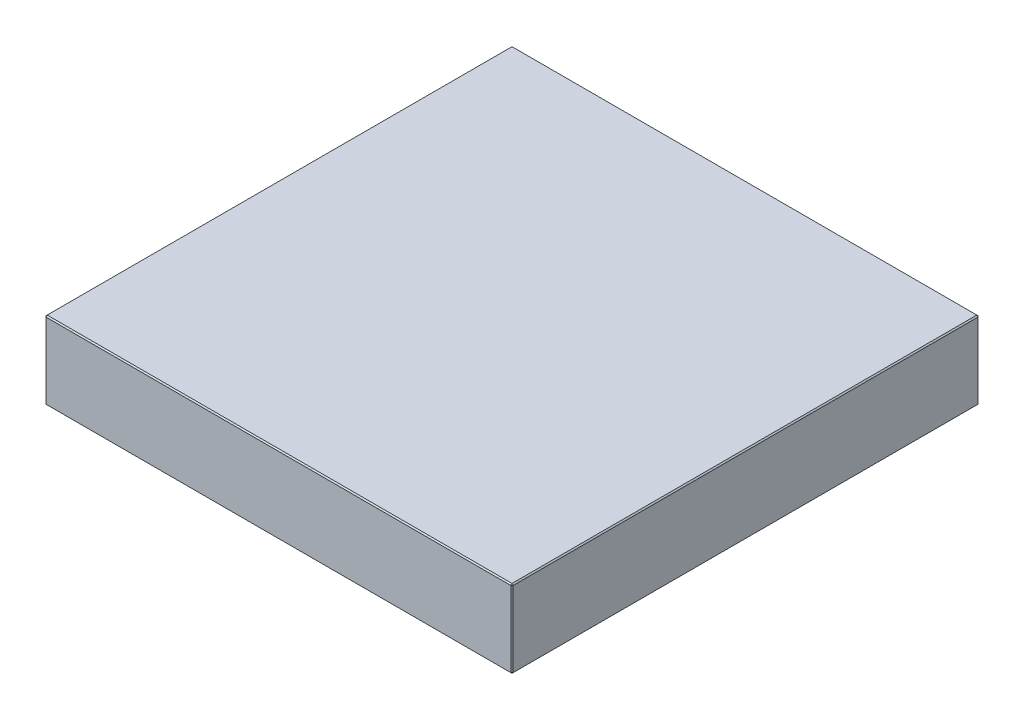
ISO-10303-21;
HEADER;
FILE_DESCRIPTION(('STEP AP214'),'2;1');
FILE_NAME('part.step','',(''),(''),'','','');
FILE_SCHEMA(('AUTOMOTIVE_DESIGN { 1 0 10303 214 1 1 1 1 }'));
ENDSEC;
DATA;
#1=APPLICATION_CONTEXT('core data for automotive mechanical design processes');
#2=APPLICATION_PROTOCOL_DEFINITION('international standard','automotive_design',2000,#1);
#3=PRODUCT_CONTEXT('',#1,'mechanical');
#4=PRODUCT('Part','Part','',(#3));
#5=PRODUCT_RELATED_PRODUCT_CATEGORY('part','',(#4));
#6=PRODUCT_DEFINITION_FORMATION('','',#4);
#7=PRODUCT_DEFINITION_CONTEXT('part definition',#1,'design');
#8=PRODUCT_DEFINITION('design','',#6,#7);
#9=PRODUCT_DEFINITION_SHAPE('','',#8);
#10=(LENGTH_UNIT() NAMED_UNIT(*) SI_UNIT(.MILLI.,.METRE.));
#11=(NAMED_UNIT(*) PLANE_ANGLE_UNIT() SI_UNIT($,.RADIAN.));
#12=(NAMED_UNIT(*) SI_UNIT($,.STERADIAN.) SOLID_ANGLE_UNIT());
#13=UNCERTAINTY_MEASURE_WITH_UNIT(LENGTH_MEASURE(1.E-05),#10,'distance_accuracy_value','');
#14=(GEOMETRIC_REPRESENTATION_CONTEXT(3) GLOBAL_UNCERTAINTY_ASSIGNED_CONTEXT((#13)) GLOBAL_UNIT_ASSIGNED_CONTEXT((#10,
#11,#12)) REPRESENTATION_CONTEXT('',''));
#15=CARTESIAN_POINT('',(0.,0.,0.));
#16=DIRECTION('',(0.,0.,1.));
#17=DIRECTION('',(1.,0.,0.));
#18=AXIS2_PLACEMENT_3D('',#15,#16,#17);
#19=CARTESIAN_POINT('',(-198.,66.,198.));
#20=DIRECTION('',(1.,0.,0.));
#21=DIRECTION('',(0.,0.,-1.));
#22=AXIS2_PLACEMENT_3D('',#19,#20,#21);
#23=PLANE('',#22);
#24=DIRECTION('',(0.,-1.,0.));
#25=VECTOR('',#24,1.);
#26=CARTESIAN_POINT('',(-198.,66.,-197.));
#27=LINE('',#26,#25);
#28=CARTESIAN_POINT('',(-198.,65.,-197.));
#29=VERTEX_POINT('',#28);
#30=CARTESIAN_POINT('',(-198.,1.,-197.));
#31=VERTEX_POINT('',#30);
#32=EDGE_CURVE('E114',#29,#31,#27,.T.);
#33=ORIENTED_EDGE('',*,*,#32,.T.);
#34=DIRECTION('',(0.,0.,1.));
#35=VECTOR('',#34,1.);
#36=CARTESIAN_POINT('',(-198.,1.,198.));
#37=LINE('',#36,#35);
#38=CARTESIAN_POINT('',(-198.,1.,197.));
#39=VERTEX_POINT('',#38);
#40=EDGE_CURVE('E110',#31,#39,#37,.T.);
#41=ORIENTED_EDGE('',*,*,#40,.T.);
#42=DIRECTION('',(0.,1.,0.));
#43=VECTOR('',#42,1.);
#44=CARTESIAN_POINT('',(-198.,66.,197.));
#45=LINE('',#44,#43);
#46=CARTESIAN_POINT('',(-198.,65.,197.));
#47=VERTEX_POINT('',#46);
#48=EDGE_CURVE('E103',#39,#47,#45,.T.);
#49=ORIENTED_EDGE('',*,*,#48,.T.);
#50=DIRECTION('',(0.,0.,-1.));
#51=VECTOR('',#50,1.);
#52=CARTESIAN_POINT('',(-198.,65.,-198.));
#53=LINE('',#52,#51);
#54=EDGE_CURVE('E107',#47,#29,#53,.T.);
#55=ORIENTED_EDGE('',*,*,#54,.T.);
#56=EDGE_LOOP('',(#33,#41,#49,#55));
#57=FACE_BOUND('',#56,.T.);
#58=ADVANCED_FACE('F15',(#57),#23,.F.);
#59=CARTESIAN_POINT('',(198.,66.,198.));
#60=DIRECTION('',(0.,0.,-1.));
#61=DIRECTION('',(-1.,0.,0.));
#62=AXIS2_PLACEMENT_3D('',#59,#60,#61);
#63=PLANE('',#62);
#64=DIRECTION('',(-1.,0.,0.));
#65=VECTOR('',#64,1.);
#66=CARTESIAN_POINT('',(-198.,65.,198.));
#67=LINE('',#66,#65);
#68=CARTESIAN_POINT('',(197.,65.,198.));
#69=VERTEX_POINT('',#68);
#70=CARTESIAN_POINT('',(-197.,65.,198.));
#71=VERTEX_POINT('',#70);
#72=EDGE_CURVE('E164',#69,#71,#67,.T.);
#73=ORIENTED_EDGE('',*,*,#72,.T.);
#74=DIRECTION('',(0.,-1.,0.));
#75=VECTOR('',#74,1.);
#76=CARTESIAN_POINT('',(-197.,66.,198.));
#77=LINE('',#76,#75);
#78=CARTESIAN_POINT('',(-197.,1.,198.));
#79=VERTEX_POINT('',#78);
#80=EDGE_CURVE('E122',#71,#79,#77,.T.);
#81=ORIENTED_EDGE('',*,*,#80,.T.);
#82=DIRECTION('',(1.,0.,0.));
#83=VECTOR('',#82,1.);
#84=CARTESIAN_POINT('',(198.,1.,198.));
#85=LINE('',#84,#83);
#86=CARTESIAN_POINT('',(197.,1.,198.));
#87=VERTEX_POINT('',#86);
#88=EDGE_CURVE('E168',#79,#87,#85,.T.);
#89=ORIENTED_EDGE('',*,*,#88,.T.);
#90=DIRECTION('',(0.,1.,0.));
#91=VECTOR('',#90,1.);
#92=CARTESIAN_POINT('',(197.,66.,198.));
#93=LINE('',#92,#91);
#94=EDGE_CURVE('E166',#87,#69,#93,.T.);
#95=ORIENTED_EDGE('',*,*,#94,.T.);
#96=EDGE_LOOP('',(#73,#81,#89,#95));
#97=FACE_BOUND('',#96,.T.);
#98=ADVANCED_FACE('F275',(#97),#63,.F.);
#99=CARTESIAN_POINT('',(198.,66.,198.));
#100=DIRECTION('',(-1.,0.,0.));
#101=DIRECTION('',(0.,0.,1.));
#102=AXIS2_PLACEMENT_3D('',#99,#100,#101);
#103=PLANE('',#102);
#104=DIRECTION('',(0.,0.,-1.));
#105=VECTOR('',#104,1.);
#106=CARTESIAN_POINT('',(198.,1.,198.));
#107=LINE('',#106,#105);
#108=CARTESIAN_POINT('',(198.,1.,197.));
#109=VERTEX_POINT('',#108);
#110=CARTESIAN_POINT('',(198.,1.,-197.));
#111=VERTEX_POINT('',#110);
#112=EDGE_CURVE('E159',#109,#111,#107,.T.);
#113=ORIENTED_EDGE('',*,*,#112,.T.);
#114=DIRECTION('',(0.,1.,0.));
#115=VECTOR('',#114,1.);
#116=CARTESIAN_POINT('',(198.,66.,-197.));
#117=LINE('',#116,#115);
#118=CARTESIAN_POINT('',(198.,65.,-197.));
#119=VERTEX_POINT('',#118);
#120=EDGE_CURVE('E161',#111,#119,#117,.T.);
#121=ORIENTED_EDGE('',*,*,#120,.T.);
#122=DIRECTION('',(0.,0.,1.));
#123=VECTOR('',#122,1.);
#124=CARTESIAN_POINT('',(198.,65.,198.));
#125=LINE('',#124,#123);
#126=CARTESIAN_POINT('',(198.,65.,197.));
#127=VERTEX_POINT('',#126);
#128=EDGE_CURVE('E155',#119,#127,#125,.T.);
#129=ORIENTED_EDGE('',*,*,#128,.T.);
#130=DIRECTION('',(0.,-1.,0.));
#131=VECTOR('',#130,1.);
#132=CARTESIAN_POINT('',(198.,66.,197.));
#133=LINE('',#132,#131);
#134=EDGE_CURVE('E157',#127,#109,#133,.T.);
#135=ORIENTED_EDGE('',*,*,#134,.T.);
#136=EDGE_LOOP('',(#113,#121,#129,#135));
#137=FACE_BOUND('',#136,.T.);
#138=ADVANCED_FACE('F254',(#137),#103,.F.);
#139=CARTESIAN_POINT('',(198.,66.,-198.));
#140=DIRECTION('',(0.,0.,1.));
#141=DIRECTION('',(1.,0.,0.));
#142=AXIS2_PLACEMENT_3D('',#139,#140,#141);
#143=PLANE('',#142);
#144=DIRECTION('',(0.,-1.,0.));
#145=VECTOR('',#144,1.);
#146=CARTESIAN_POINT('',(197.,66.,-198.));
#147=LINE('',#146,#145);
#148=CARTESIAN_POINT('',(197.,65.,-198.));
#149=VERTEX_POINT('',#148);
#150=CARTESIAN_POINT('',(197.,1.,-198.));
#151=VERTEX_POINT('',#150);
#152=EDGE_CURVE('E148',#149,#151,#147,.T.);
#153=ORIENTED_EDGE('',*,*,#152,.T.);
#154=DIRECTION('',(-1.,0.,0.));
#155=VECTOR('',#154,1.);
#156=CARTESIAN_POINT('',(198.,1.,-198.));
#157=LINE('',#156,#155);
#158=CARTESIAN_POINT('',(-197.,1.,-198.));
#159=VERTEX_POINT('',#158);
#160=EDGE_CURVE('E153',#151,#159,#157,.T.);
#161=ORIENTED_EDGE('',*,*,#160,.T.);
#162=DIRECTION('',(0.,1.,0.));
#163=VECTOR('',#162,1.);
#164=CARTESIAN_POINT('',(-197.,66.,-198.));
#165=LINE('',#164,#163);
#166=CARTESIAN_POINT('',(-197.,65.,-198.));
#167=VERTEX_POINT('',#166);
#168=EDGE_CURVE('E150',#159,#167,#165,.T.);
#169=ORIENTED_EDGE('',*,*,#168,.T.);
#170=DIRECTION('',(1.,0.,0.));
#171=VECTOR('',#170,1.);
#172=CARTESIAN_POINT('',(198.,65.,-198.));
#173=LINE('',#172,#171);
#174=EDGE_CURVE('E146',#167,#149,#173,.T.);
#175=ORIENTED_EDGE('',*,*,#174,.T.);
#176=EDGE_LOOP('',(#153,#161,#169,#175));
#177=FACE_BOUND('',#176,.T.);
#178=ADVANCED_FACE('F284',(#177),#143,.F.);
#179=CARTESIAN_POINT('',(0.,66.,0.));
#180=DIRECTION('',(0.,1.,0.));
#181=DIRECTION('',(0.,0.,1.));
#182=AXIS2_PLACEMENT_3D('',#179,#180,#181);
#183=PLANE('',#182);
#184=DIRECTION('',(0.,0.,-1.));
#185=VECTOR('',#184,1.);
#186=CARTESIAN_POINT('',(197.,66.,-198.));
#187=LINE('',#186,#185);
#188=CARTESIAN_POINT('',(197.,66.,197.));
#189=VERTEX_POINT('',#188);
#190=CARTESIAN_POINT('',(197.,66.,-197.));
#191=VERTEX_POINT('',#190);
#192=EDGE_CURVE('E24',#189,#191,#187,.T.);
#193=ORIENTED_EDGE('',*,*,#192,.T.);
#194=DIRECTION('',(-1.,0.,0.));
#195=VECTOR('',#194,1.);
#196=CARTESIAN_POINT('',(-198.,66.,-197.));
#197=LINE('',#196,#195);
#198=CARTESIAN_POINT('',(-197.,66.,-197.));
#199=VERTEX_POINT('',#198);
#200=EDGE_CURVE('E9',#191,#199,#197,.T.);
#201=ORIENTED_EDGE('',*,*,#200,.T.);
#202=DIRECTION('',(0.,0.,1.));
#203=VECTOR('',#202,1.);
#204=CARTESIAN_POINT('',(-197.,66.,198.));
#205=LINE('',#204,#203);
#206=CARTESIAN_POINT('',(-197.,66.,197.));
#207=VERTEX_POINT('',#206);
#208=EDGE_CURVE('E180',#199,#207,#205,.T.);
#209=ORIENTED_EDGE('',*,*,#208,.T.);
#210=DIRECTION('',(1.,0.,0.));
#211=VECTOR('',#210,1.);
#212=CARTESIAN_POINT('',(198.,66.,197.));
#213=LINE('',#212,#211);
#214=EDGE_CURVE('E35',#207,#189,#213,.T.);
#215=ORIENTED_EDGE('',*,*,#214,.T.);
#216=EDGE_LOOP('',(#193,#201,#209,#215));
#217=FACE_BOUND('',#216,.T.);
#218=ADVANCED_FACE('F350',(#217),#183,.T.);
#219=CARTESIAN_POINT('',(0.,0.,0.));
#220=DIRECTION('',(0.,1.,0.));
#221=DIRECTION('',(0.,0.,1.));
#222=AXIS2_PLACEMENT_3D('',#219,#220,#221);
#223=PLANE('',#222);
#224=DIRECTION('',(0.,0.,1.));
#225=VECTOR('',#224,1.);
#226=CARTESIAN_POINT('',(197.,0.,0.));
#227=LINE('',#226,#225);
#228=CARTESIAN_POINT('',(197.,0.,-197.));
#229=VERTEX_POINT('',#228);
#230=CARTESIAN_POINT('',(197.,0.,197.));
#231=VERTEX_POINT('',#230);
#232=EDGE_CURVE('E171',#229,#231,#227,.T.);
#233=ORIENTED_EDGE('',*,*,#232,.T.);
#234=DIRECTION('',(-1.,0.,0.));
#235=VECTOR('',#234,1.);
#236=CARTESIAN_POINT('',(0.,0.,197.));
#237=LINE('',#236,#235);
#238=CARTESIAN_POINT('',(-197.,0.,197.));
#239=VERTEX_POINT('',#238);
#240=EDGE_CURVE('E177',#231,#239,#237,.T.);
#241=ORIENTED_EDGE('',*,*,#240,.T.);
#242=DIRECTION('',(0.,0.,-1.));
#243=VECTOR('',#242,1.);
#244=CARTESIAN_POINT('',(-197.,0.,0.));
#245=LINE('',#244,#243);
#246=CARTESIAN_POINT('',(-197.,0.,-197.));
#247=VERTEX_POINT('',#246);
#248=EDGE_CURVE('E175',#239,#247,#245,.T.);
#249=ORIENTED_EDGE('',*,*,#248,.T.);
#250=DIRECTION('',(1.,0.,0.));
#251=VECTOR('',#250,1.);
#252=CARTESIAN_POINT('',(0.,0.,-197.));
#253=LINE('',#252,#251);
#254=EDGE_CURVE('E173',#247,#229,#253,.T.);
#255=ORIENTED_EDGE('',*,*,#254,.T.);
#256=EDGE_LOOP('',(#233,#241,#249,#255));
#257=FACE_BOUND('',#256,.T.);
#258=ADVANCED_FACE('F246',(#257),#223,.F.);
#259=CARTESIAN_POINT('',(198.,66.,197.));
#260=DIRECTION('',(-0.707106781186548,0.,-0.707106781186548));
#261=DIRECTION('',(0.,-1.,0.));
#262=AXIS2_PLACEMENT_3D('',#259,#260,#261);
#263=PLANE('',#262);
#264=DIRECTION('',(-0.707106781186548,0.,0.707106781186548));
#265=VECTOR('',#264,1.);
#266=CARTESIAN_POINT('',(197.,65.,198.));
#267=LINE('',#266,#265);
#268=EDGE_CURVE('E19',#69,#127,#267,.F.);
#269=ORIENTED_EDGE('',*,*,#268,.F.);
#270=ORIENTED_EDGE('',*,*,#94,.F.);
#271=DIRECTION('',(0.707106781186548,0.,-0.707106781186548));
#272=VECTOR('',#271,1.);
#273=CARTESIAN_POINT('',(197.,1.,198.));
#274=LINE('',#273,#272);
#275=EDGE_CURVE('E142',#109,#87,#274,.F.);
#276=ORIENTED_EDGE('',*,*,#275,.F.);
#277=ORIENTED_EDGE('',*,*,#134,.F.);
#278=EDGE_LOOP('',(#269,#270,#276,#277));
#279=FACE_BOUND('',#278,.T.);
#280=ADVANCED_FACE('F17',(#279),#263,.F.);
#281=CARTESIAN_POINT('',(197.,65.,198.));
#282=DIRECTION('',(0.577350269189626,0.577350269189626,0.577350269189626));
#283=DIRECTION('',(0.707106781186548,0.,-0.707106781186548));
#284=AXIS2_PLACEMENT_3D('',#281,#282,#283);
#285=PLANE('',#284);
#286=DIRECTION('',(0.,-0.707106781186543,0.707106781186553));
#287=VECTOR('',#286,1.);
#288=CARTESIAN_POINT('',(197.,65.,198.));
#289=LINE('',#288,#287);
#290=EDGE_CURVE('E226',#69,#189,#289,.F.);
#291=ORIENTED_EDGE('',*,*,#290,.F.);
#292=ORIENTED_EDGE('',*,*,#268,.T.);
#293=DIRECTION('',(-0.707106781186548,0.707106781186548,0.));
#294=VECTOR('',#293,1.);
#295=CARTESIAN_POINT('',(197.5,65.5,197.));
#296=LINE('',#295,#294);
#297=EDGE_CURVE('E228',#189,#127,#296,.F.);
#298=ORIENTED_EDGE('',*,*,#297,.F.);
#299=EDGE_LOOP('',(#291,#292,#298));
#300=FACE_BOUND('',#299,.T.);
#301=ADVANCED_FACE('F270',(#300),#285,.T.);
#302=CARTESIAN_POINT('',(197.,1.,198.));
#303=DIRECTION('',(0.57735026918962,-0.577350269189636,0.57735026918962));
#304=DIRECTION('',(0.,-0.707106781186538,-0.707106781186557));
#305=AXIS2_PLACEMENT_3D('',#302,#303,#304);
#306=PLANE('',#305);
#307=DIRECTION('',(-0.707106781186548,-0.707106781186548,0.));
#308=VECTOR('',#307,1.);
#309=CARTESIAN_POINT('',(197.5,0.500000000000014,197.));
#310=LINE('',#309,#308);
#311=EDGE_CURVE('E220',#109,#231,#310,.T.);
#312=ORIENTED_EDGE('',*,*,#311,.F.);
#313=ORIENTED_EDGE('',*,*,#275,.T.);
#314=DIRECTION('',(0.,0.707106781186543,0.707106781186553));
#315=VECTOR('',#314,1.);
#316=CARTESIAN_POINT('',(197.,1.,198.));
#317=LINE('',#316,#315);
#318=EDGE_CURVE('E223',#231,#87,#317,.T.);
#319=ORIENTED_EDGE('',*,*,#318,.F.);
#320=EDGE_LOOP('',(#312,#313,#319));
#321=FACE_BOUND('',#320,.T.);
#322=ADVANCED_FACE('F235',(#321),#306,.T.);
#323=CARTESIAN_POINT('',(197.,66.,0.));
#324=DIRECTION('',(0.707106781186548,0.707106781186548,0.));
#325=DIRECTION('',(0.,0.,1.));
#326=AXIS2_PLACEMENT_3D('',#323,#324,#325);
#327=PLANE('',#326);
#328=ORIENTED_EDGE('',*,*,#297,.T.);
#329=ORIENTED_EDGE('',*,*,#128,.F.);
#330=DIRECTION('',(0.707106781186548,-0.707106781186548,0.));
#331=VECTOR('',#330,1.);
#332=CARTESIAN_POINT('',(198.,65.,-197.));
#333=LINE('',#332,#331);
#334=EDGE_CURVE('E215',#191,#119,#333,.T.);
#335=ORIENTED_EDGE('',*,*,#334,.F.);
#336=ORIENTED_EDGE('',*,*,#192,.F.);
#337=EDGE_LOOP('',(#328,#329,#335,#336));
#338=FACE_BOUND('',#337,.T.);
#339=ADVANCED_FACE('F265',(#338),#327,.T.);
#340=CARTESIAN_POINT('',(0.,66.,197.));
#341=DIRECTION('',(0.,0.707106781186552,0.707106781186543));
#342=DIRECTION('',(-1.,0.,0.));
#343=AXIS2_PLACEMENT_3D('',#340,#341,#342);
#344=PLANE('',#343);
#345=ORIENTED_EDGE('',*,*,#290,.T.);
#346=ORIENTED_EDGE('',*,*,#214,.F.);
#347=DIRECTION('',(0.,0.707106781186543,-0.707106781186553));
#348=VECTOR('',#347,1.);
#349=CARTESIAN_POINT('',(-197.,65.5,197.5));
#350=LINE('',#349,#348);
#351=EDGE_CURVE('E126',#71,#207,#350,.T.);
#352=ORIENTED_EDGE('',*,*,#351,.F.);
#353=ORIENTED_EDGE('',*,*,#72,.F.);
#354=EDGE_LOOP('',(#345,#346,#352,#353));
#355=FACE_BOUND('',#354,.T.);
#356=ADVANCED_FACE('F273',(#355),#344,.T.);
#357=CARTESIAN_POINT('',(-197.,66.,198.));
#358=DIRECTION('',(0.707106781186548,0.,-0.707106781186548));
#359=DIRECTION('',(0.,-1.,0.));
#360=AXIS2_PLACEMENT_3D('',#357,#358,#359);
#361=PLANE('',#360);
#362=DIRECTION('',(0.707106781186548,0.,0.707106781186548));
#363=VECTOR('',#362,1.);
#364=CARTESIAN_POINT('',(-197.,1.,198.));
#365=LINE('',#364,#363);
#366=EDGE_CURVE('E127',#79,#39,#365,.F.);
#367=ORIENTED_EDGE('',*,*,#366,.F.);
#368=ORIENTED_EDGE('',*,*,#80,.F.);
#369=DIRECTION('',(-0.707106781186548,0.,-0.707106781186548));
#370=VECTOR('',#369,1.);
#371=CARTESIAN_POINT('',(-198.,65.,197.));
#372=LINE('',#371,#370);
#373=EDGE_CURVE('E118',#47,#71,#372,.F.);
#374=ORIENTED_EDGE('',*,*,#373,.F.);
#375=ORIENTED_EDGE('',*,*,#48,.F.);
#376=EDGE_LOOP('',(#367,#368,#374,#375));
#377=FACE_BOUND('',#376,.T.);
#378=ADVANCED_FACE('F120',(#377),#361,.F.);
#379=CARTESIAN_POINT('',(198.,1.,198.));
#380=DIRECTION('',(0.,0.707106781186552,-0.707106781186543));
#381=DIRECTION('',(1.,0.,0.));
#382=AXIS2_PLACEMENT_3D('',#379,#380,#381);
#383=PLANE('',#382);
#384=ORIENTED_EDGE('',*,*,#318,.T.);
#385=ORIENTED_EDGE('',*,*,#88,.F.);
#386=DIRECTION('',(0.,-0.707106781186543,-0.707106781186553));
#387=VECTOR('',#386,1.);
#388=CARTESIAN_POINT('',(-197.,1.,198.));
#389=LINE('',#388,#387);
#390=EDGE_CURVE('E211',#239,#79,#389,.F.);
#391=ORIENTED_EDGE('',*,*,#390,.F.);
#392=ORIENTED_EDGE('',*,*,#240,.F.);
#393=EDGE_LOOP('',(#384,#385,#391,#392));
#394=FACE_BOUND('',#393,.T.);
#395=ADVANCED_FACE('F243',(#394),#383,.F.);
#396=CARTESIAN_POINT('',(198.,1.,198.));
#397=DIRECTION('',(-0.707106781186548,0.707106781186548,0.));
#398=DIRECTION('',(0.,0.,-1.));
#399=AXIS2_PLACEMENT_3D('',#396,#397,#398);
#400=PLANE('',#399);
#401=ORIENTED_EDGE('',*,*,#311,.T.);
#402=ORIENTED_EDGE('',*,*,#232,.F.);
#403=DIRECTION('',(0.707106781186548,0.707106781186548,0.));
#404=VECTOR('',#403,1.);
#405=CARTESIAN_POINT('',(197.5,0.499999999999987,-197.));
#406=LINE('',#405,#404);
#407=EDGE_CURVE('E208',#111,#229,#406,.F.);
#408=ORIENTED_EDGE('',*,*,#407,.F.);
#409=ORIENTED_EDGE('',*,*,#112,.F.);
#410=EDGE_LOOP('',(#401,#402,#408,#409));
#411=FACE_BOUND('',#410,.T.);
#412=ADVANCED_FACE('F251',(#411),#400,.F.);
#413=CARTESIAN_POINT('',(197.,66.,-198.));
#414=DIRECTION('',(-0.707106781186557,0.,0.707106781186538));
#415=DIRECTION('',(0.,-1.,0.));
#416=AXIS2_PLACEMENT_3D('',#413,#414,#415);
#417=PLANE('',#416);
#418=DIRECTION('',(0.707106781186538,0.,0.707106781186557));
#419=VECTOR('',#418,1.);
#420=CARTESIAN_POINT('',(198.,65.,-197.));
#421=LINE('',#420,#419);
#422=EDGE_CURVE('E217',#119,#149,#421,.F.);
#423=ORIENTED_EDGE('',*,*,#422,.F.);
#424=ORIENTED_EDGE('',*,*,#120,.F.);
#425=DIRECTION('',(-0.707106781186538,0.,-0.707106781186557));
#426=VECTOR('',#425,1.);
#427=CARTESIAN_POINT('',(197.,1.,-198.));
#428=LINE('',#427,#426);
#429=EDGE_CURVE('E205',#151,#111,#428,.F.);
#430=ORIENTED_EDGE('',*,*,#429,.F.);
#431=ORIENTED_EDGE('',*,*,#152,.F.);
#432=EDGE_LOOP('',(#423,#424,#430,#431));
#433=FACE_BOUND('',#432,.T.);
#434=ADVANCED_FACE('F258',(#433),#417,.F.);
#435=CARTESIAN_POINT('',(198.,65.,-197.));
#436=DIRECTION('',(0.577350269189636,0.57735026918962,-0.57735026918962));
#437=DIRECTION('',(-0.707106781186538,0.,-0.707106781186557));
#438=AXIS2_PLACEMENT_3D('',#435,#436,#437);
#439=PLANE('',#438);
#440=ORIENTED_EDGE('',*,*,#334,.T.);
#441=ORIENTED_EDGE('',*,*,#422,.T.);
#442=DIRECTION('',(0.,0.707106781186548,0.707106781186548));
#443=VECTOR('',#442,1.);
#444=CARTESIAN_POINT('',(197.,65.5,-197.5));
#445=LINE('',#444,#443);
#446=EDGE_CURVE('E134',#191,#149,#445,.F.);
#447=ORIENTED_EDGE('',*,*,#446,.F.);
#448=EDGE_LOOP('',(#440,#441,#447));
#449=FACE_BOUND('',#448,.T.);
#450=ADVANCED_FACE('F325',(#449),#439,.T.);
#451=CARTESIAN_POINT('',(-198.,65.,197.));
#452=DIRECTION('',(-0.577350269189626,0.577350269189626,0.577350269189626));
#453=DIRECTION('',(0.707106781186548,0.,0.707106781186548));
#454=AXIS2_PLACEMENT_3D('',#451,#452,#453);
#455=PLANE('',#454);
#456=ORIENTED_EDGE('',*,*,#373,.T.);
#457=ORIENTED_EDGE('',*,*,#351,.T.);
#458=DIRECTION('',(-0.707106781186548,-0.707106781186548,0.));
#459=VECTOR('',#458,1.);
#460=CARTESIAN_POINT('',(-198.,65.,197.));
#461=LINE('',#460,#459);
#462=EDGE_CURVE('E130',#47,#207,#461,.F.);
#463=ORIENTED_EDGE('',*,*,#462,.F.);
#464=EDGE_LOOP('',(#456,#457,#463));
#465=FACE_BOUND('',#464,.T.);
#466=ADVANCED_FACE('F131',(#465),#455,.T.);
#467=CARTESIAN_POINT('',(-197.,1.,198.));
#468=DIRECTION('',(-0.57735026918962,-0.577350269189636,0.57735026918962));
#469=DIRECTION('',(0.,-0.707106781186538,-0.707106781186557));
#470=AXIS2_PLACEMENT_3D('',#467,#468,#469);
#471=PLANE('',#470);
#472=ORIENTED_EDGE('',*,*,#390,.T.);
#473=ORIENTED_EDGE('',*,*,#366,.T.);
#474=DIRECTION('',(-0.707106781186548,0.707106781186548,0.));
#475=VECTOR('',#474,1.);
#476=CARTESIAN_POINT('',(-197.5,0.500000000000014,197.));
#477=LINE('',#476,#475);
#478=EDGE_CURVE('E135',#239,#39,#477,.T.);
#479=ORIENTED_EDGE('',*,*,#478,.F.);
#480=EDGE_LOOP('',(#472,#473,#479));
#481=FACE_BOUND('',#480,.T.);
#482=ADVANCED_FACE('F318',(#481),#471,.T.);
#483=CARTESIAN_POINT('',(197.,1.,-198.));
#484=DIRECTION('',(0.577350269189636,-0.57735026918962,-0.57735026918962));
#485=DIRECTION('',(-0.707106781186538,0.,-0.707106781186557));
#486=AXIS2_PLACEMENT_3D('',#483,#484,#485);
#487=PLANE('',#486);
#488=ORIENTED_EDGE('',*,*,#429,.T.);
#489=ORIENTED_EDGE('',*,*,#407,.T.);
#490=DIRECTION('',(0.,-0.707106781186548,0.707106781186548));
#491=VECTOR('',#490,1.);
#492=CARTESIAN_POINT('',(197.,1.,-198.));
#493=LINE('',#492,#491);
#494=EDGE_CURVE('E198',#151,#229,#493,.T.);
#495=ORIENTED_EDGE('',*,*,#494,.F.);
#496=EDGE_LOOP('',(#488,#489,#495));
#497=FACE_BOUND('',#496,.T.);
#498=ADVANCED_FACE('F314',(#497),#487,.T.);
#499=CARTESIAN_POINT('',(0.,66.,-197.));
#500=DIRECTION('',(0.,0.707106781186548,-0.707106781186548));
#501=DIRECTION('',(1.,0.,0.));
#502=AXIS2_PLACEMENT_3D('',#499,#500,#501);
#503=PLANE('',#502);
#504=ORIENTED_EDGE('',*,*,#446,.T.);
#505=ORIENTED_EDGE('',*,*,#174,.F.);
#506=DIRECTION('',(0.,-0.707106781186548,-0.707106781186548));
#507=VECTOR('',#506,1.);
#508=CARTESIAN_POINT('',(-197.,65.,-198.));
#509=LINE('',#508,#507);
#510=EDGE_CURVE('E195',#199,#167,#509,.T.);
#511=ORIENTED_EDGE('',*,*,#510,.F.);
#512=ORIENTED_EDGE('',*,*,#200,.F.);
#513=EDGE_LOOP('',(#504,#505,#511,#512));
#514=FACE_BOUND('',#513,.T.);
#515=ADVANCED_FACE('F311',(#514),#503,.T.);
#516=CARTESIAN_POINT('',(-197.,66.,0.));
#517=DIRECTION('',(-0.707106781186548,0.707106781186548,0.));
#518=DIRECTION('',(0.,0.,-1.));
#519=AXIS2_PLACEMENT_3D('',#516,#517,#518);
#520=PLANE('',#519);
#521=ORIENTED_EDGE('',*,*,#462,.T.);
#522=ORIENTED_EDGE('',*,*,#208,.F.);
#523=DIRECTION('',(0.707106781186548,0.707106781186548,0.));
#524=VECTOR('',#523,1.);
#525=CARTESIAN_POINT('',(-197.5,65.5,-197.));
#526=LINE('',#525,#524);
#527=EDGE_CURVE('E138',#29,#199,#526,.T.);
#528=ORIENTED_EDGE('',*,*,#527,.F.);
#529=ORIENTED_EDGE('',*,*,#54,.F.);
#530=EDGE_LOOP('',(#521,#522,#528,#529));
#531=FACE_BOUND('',#530,.T.);
#532=ADVANCED_FACE('F137',(#531),#520,.T.);
#533=CARTESIAN_POINT('',(-198.,1.,198.));
#534=DIRECTION('',(0.707106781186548,0.707106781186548,0.));
#535=DIRECTION('',(0.,0.,1.));
#536=AXIS2_PLACEMENT_3D('',#533,#534,#535);
#537=PLANE('',#536);
#538=ORIENTED_EDGE('',*,*,#478,.T.);
#539=ORIENTED_EDGE('',*,*,#40,.F.);
#540=DIRECTION('',(0.707106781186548,-0.707106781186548,0.));
#541=VECTOR('',#540,1.);
#542=CARTESIAN_POINT('',(-198.,1.,-197.));
#543=LINE('',#542,#541);
#544=EDGE_CURVE('E191',#247,#31,#543,.F.);
#545=ORIENTED_EDGE('',*,*,#544,.F.);
#546=ORIENTED_EDGE('',*,*,#248,.F.);
#547=EDGE_LOOP('',(#538,#539,#545,#546));
#548=FACE_BOUND('',#547,.T.);
#549=ADVANCED_FACE('F304',(#548),#537,.F.);
#550=CARTESIAN_POINT('',(198.,1.,-198.));
#551=DIRECTION('',(0.,0.707106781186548,0.707106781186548));
#552=DIRECTION('',(-1.,0.,0.));
#553=AXIS2_PLACEMENT_3D('',#550,#551,#552);
#554=PLANE('',#553);
#555=ORIENTED_EDGE('',*,*,#494,.T.);
#556=ORIENTED_EDGE('',*,*,#254,.F.);
#557=DIRECTION('',(0.,0.707106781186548,-0.707106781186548));
#558=VECTOR('',#557,1.);
#559=CARTESIAN_POINT('',(-197.,0.5,-197.5));
#560=LINE('',#559,#558);
#561=EDGE_CURVE('E188',#159,#247,#560,.F.);
#562=ORIENTED_EDGE('',*,*,#561,.F.);
#563=ORIENTED_EDGE('',*,*,#160,.F.);
#564=EDGE_LOOP('',(#555,#556,#562,#563));
#565=FACE_BOUND('',#564,.T.);
#566=ADVANCED_FACE('F300',(#565),#554,.F.);
#567=CARTESIAN_POINT('',(-197.,65.,-198.));
#568=DIRECTION('',(-0.577350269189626,0.577350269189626,-0.577350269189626));
#569=DIRECTION('',(-0.707106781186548,0.,0.707106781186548));
#570=AXIS2_PLACEMENT_3D('',#567,#568,#569);
#571=PLANE('',#570);
#572=ORIENTED_EDGE('',*,*,#527,.T.);
#573=ORIENTED_EDGE('',*,*,#510,.T.);
#574=DIRECTION('',(0.707106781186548,0.,-0.707106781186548));
#575=VECTOR('',#574,1.);
#576=CARTESIAN_POINT('',(-197.,65.,-198.));
#577=LINE('',#576,#575);
#578=EDGE_CURVE('E186',#29,#167,#577,.T.);
#579=ORIENTED_EDGE('',*,*,#578,.F.);
#580=EDGE_LOOP('',(#572,#573,#579));
#581=FACE_BOUND('',#580,.T.);
#582=ADVANCED_FACE('F296',(#581),#571,.T.);
#583=CARTESIAN_POINT('',(-198.,1.,-197.));
#584=DIRECTION('',(-0.577350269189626,-0.577350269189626,-0.577350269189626));
#585=DIRECTION('',(-0.707106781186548,0.,0.707106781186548));
#586=AXIS2_PLACEMENT_3D('',#583,#584,#585);
#587=PLANE('',#586);
#588=ORIENTED_EDGE('',*,*,#561,.T.);
#589=ORIENTED_EDGE('',*,*,#544,.T.);
#590=DIRECTION('',(-0.707106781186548,0.,0.707106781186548));
#591=VECTOR('',#590,1.);
#592=CARTESIAN_POINT('',(-198.,1.,-197.));
#593=LINE('',#592,#591);
#594=EDGE_CURVE('E184',#159,#31,#593,.T.);
#595=ORIENTED_EDGE('',*,*,#594,.F.);
#596=EDGE_LOOP('',(#588,#589,#595));
#597=FACE_BOUND('',#596,.T.);
#598=ADVANCED_FACE('F292',(#597),#587,.T.);
#599=CARTESIAN_POINT('',(-198.,66.,-197.));
#600=DIRECTION('',(0.707106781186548,0.,0.707106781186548));
#601=DIRECTION('',(0.,-1.,0.));
#602=AXIS2_PLACEMENT_3D('',#599,#600,#601);
#603=PLANE('',#602);
#604=ORIENTED_EDGE('',*,*,#578,.T.);
#605=ORIENTED_EDGE('',*,*,#168,.F.);
#606=ORIENTED_EDGE('',*,*,#594,.T.);
#607=ORIENTED_EDGE('',*,*,#32,.F.);
#608=EDGE_LOOP('',(#604,#605,#606,#607));
#609=FACE_BOUND('',#608,.T.);
#610=ADVANCED_FACE('F289',(#609),#603,.F.);
#611=CLOSED_SHELL('',(#58,#98,#138,#178,#218,#258,#280,#301,#322,#339,#356,#378,#395,#412,#434,
#450,#466,#482,#498,#515,#532,#549,#566,#582,#598,#610));
#612=MANIFOLD_SOLID_BREP('B1',#611);
#613=ADVANCED_BREP_SHAPE_REPRESENTATION('',(#18,#612),#14);
#614=SHAPE_DEFINITION_REPRESENTATION(#9,#613);
ENDSEC;
END-ISO-10303-21;
